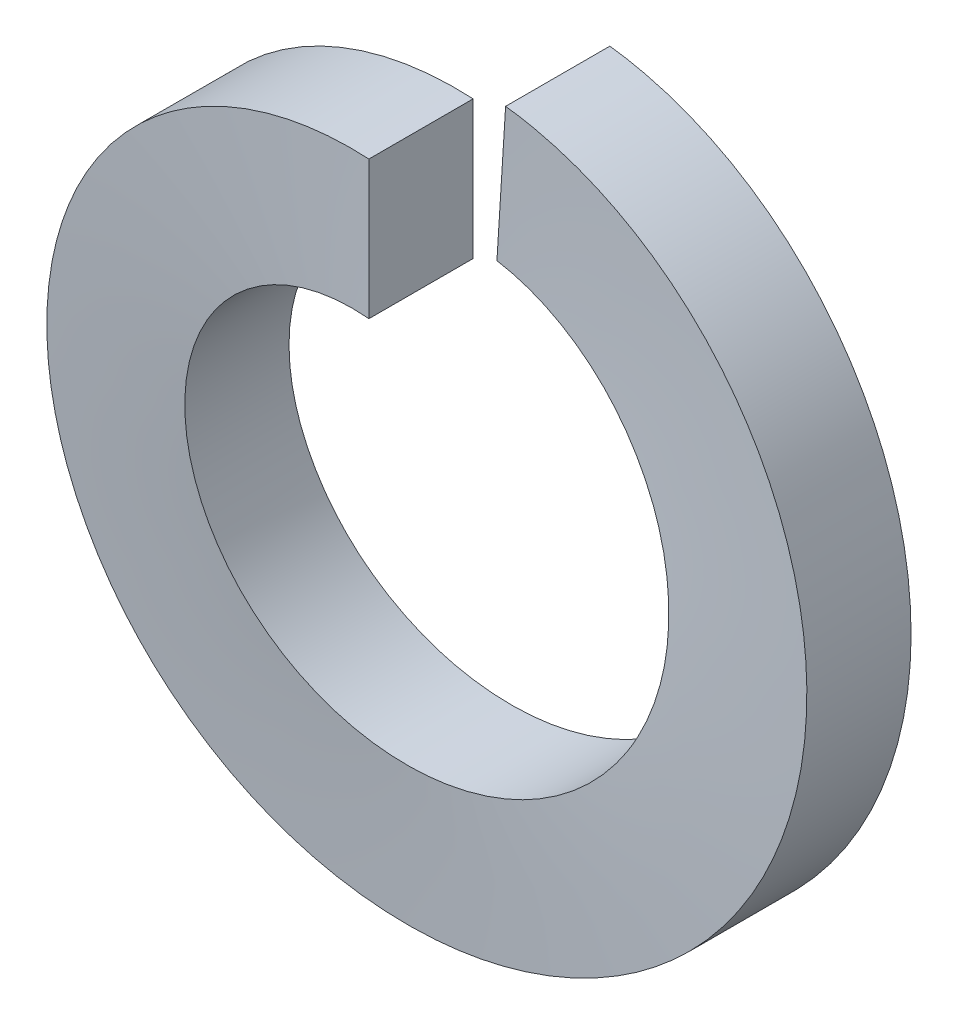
from build123d import *

# Parameters (mm, degrees)
SWEEP1_PITCH       = 5.305777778
SWEEP1_HEIGHT      = 5.25272
SWEEP1_RADIUS      = 16.0655
SWEEP1_START_ANGLE = 90
SKETCH2_W          = 4.7752
SKETCH2_H          = 6.3373


with BuildPart() as part:
    # Sweep1: sweep along a helix
    with BuildLine() as sweep1_path:
        add(Helix(SWEEP1_PITCH, SWEEP1_HEIGHT, SWEEP1_RADIUS, center=(0, 0, 0), direction=(0, 0, -1), lefthand=True, mode=Mode.PRIVATE).rotate(Axis((0, 0, 0), (0, 0, -1)), SWEEP1_START_ANGLE))
    # Sketch2 → Sweep1 (sweep)
    with BuildSketch(Plane(origin=(0, 0, 0), x_dir=(0, 0, -1), z_dir=(1, 0, 0))):
        with Locations((-2.3876, 12.89685)):
            Rectangle(SKETCH2_W, SKETCH2_H)
    sweep(path=sweep1_path.line, is_frenet=True)


solid = part.part
